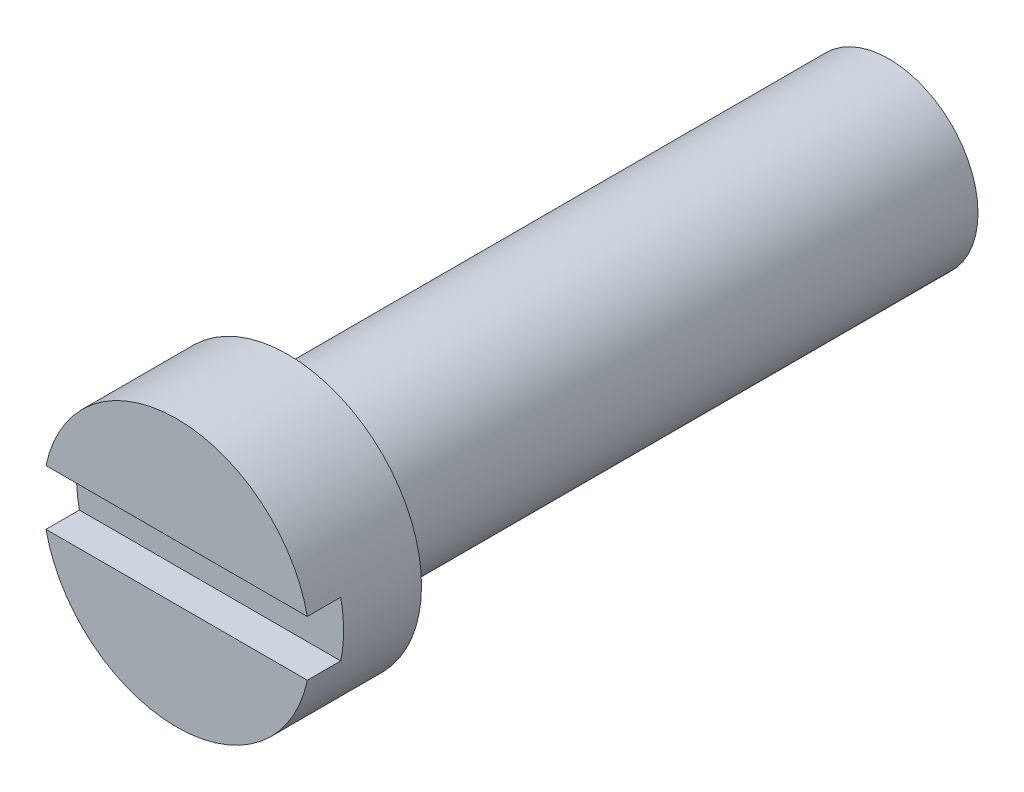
ISO-10303-21;
HEADER;
FILE_DESCRIPTION(('STEP AP214'),'2;1');
FILE_NAME('part.step','',(''),(''),'','','');
FILE_SCHEMA(('AUTOMOTIVE_DESIGN { 1 0 10303 214 1 1 1 1 }'));
ENDSEC;
DATA;
#1=APPLICATION_CONTEXT('core data for automotive mechanical design processes');
#2=APPLICATION_PROTOCOL_DEFINITION('international standard','automotive_design',2000,#1);
#3=PRODUCT_CONTEXT('',#1,'mechanical');
#4=PRODUCT('Part','Part','',(#3));
#5=PRODUCT_RELATED_PRODUCT_CATEGORY('part','',(#4));
#6=PRODUCT_DEFINITION_FORMATION('','',#4);
#7=PRODUCT_DEFINITION_CONTEXT('part definition',#1,'design');
#8=PRODUCT_DEFINITION('design','',#6,#7);
#9=PRODUCT_DEFINITION_SHAPE('','',#8);
#10=(LENGTH_UNIT() NAMED_UNIT(*) SI_UNIT(.MILLI.,.METRE.));
#11=(NAMED_UNIT(*) PLANE_ANGLE_UNIT() SI_UNIT($,.RADIAN.));
#12=(NAMED_UNIT(*) SI_UNIT($,.STERADIAN.) SOLID_ANGLE_UNIT());
#13=UNCERTAINTY_MEASURE_WITH_UNIT(LENGTH_MEASURE(1.E-05),#10,'distance_accuracy_value','');
#14=(GEOMETRIC_REPRESENTATION_CONTEXT(3) GLOBAL_UNCERTAINTY_ASSIGNED_CONTEXT((#13)) GLOBAL_UNIT_ASSIGNED_CONTEXT((#10,
#11,#12)) REPRESENTATION_CONTEXT('',''));
#15=CARTESIAN_POINT('',(0.,0.,0.));
#16=DIRECTION('',(0.,0.,1.));
#17=DIRECTION('',(1.,0.,0.));
#18=AXIS2_PLACEMENT_3D('',#15,#16,#17);
#19=CARTESIAN_POINT('',(35.,4.92661467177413E-13,5.));
#20=DIRECTION('',(0.,0.,1.));
#21=DIRECTION('',(1.,0.,0.));
#22=AXIS2_PLACEMENT_3D('',#19,#20,#21);
#23=PLANE('',#22);
#24=DIRECTION('',(-1.,0.,0.));
#25=VECTOR('',#24,1.);
#26=CARTESIAN_POINT('',(29.129487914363,1.23979347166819,5.));
#27=LINE('',#26,#25);
#28=CARTESIAN_POINT('',(40.870512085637,1.23979347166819,5.));
#29=VERTEX_POINT('',#28);
#30=CARTESIAN_POINT('',(29.129487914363,1.23979347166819,5.));
#31=VERTEX_POINT('',#30);
#32=EDGE_CURVE('E70',#29,#31,#27,.T.);
#33=ORIENTED_EDGE('',*,*,#32,.F.);
#34=CARTESIAN_POINT('',(35.,4.92661467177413E-13,5.));
#35=DIRECTION('',(0.,0.,1.));
#36=DIRECTION('',(1.,0.,0.));
#37=AXIS2_PLACEMENT_3D('',#34,#35,#36);
#38=CIRCLE('',#37,6.00000000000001);
#39=EDGE_CURVE('E107',#29,#31,#38,.T.);
#40=ORIENTED_EDGE('',*,*,#39,.T.);
#41=EDGE_LOOP('',(#33,#40));
#42=FACE_BOUND('',#41,.T.);
#43=ADVANCED_FACE('F32',(#42),#23,.T.);
#44=CARTESIAN_POINT('',(35.,4.92661467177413E-13,-27.));
#45=DIRECTION('',(0.,0.,1.));
#46=DIRECTION('',(1.,0.,0.));
#47=AXIS2_PLACEMENT_3D('',#44,#45,#46);
#48=CYLINDRICAL_SURFACE('',#47,4.);
#49=CARTESIAN_POINT('',(35.,4.92661467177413E-13,-27.));
#50=DIRECTION('',(0.,0.,1.));
#51=DIRECTION('',(1.,0.,0.));
#52=AXIS2_PLACEMENT_3D('',#49,#50,#51);
#53=CIRCLE('',#52,4.);
#54=CARTESIAN_POINT('',(39.,4.92661467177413E-13,-27.));
#55=VERTEX_POINT('',#54);
#56=EDGE_CURVE('E11',#55,#55,#53,.T.);
#57=ORIENTED_EDGE('',*,*,#56,.T.);
#58=EDGE_LOOP('',(#57));
#59=FACE_BOUND('',#58,.T.);
#60=CARTESIAN_POINT('',(35.,4.92661467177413E-13,0.));
#61=DIRECTION('',(0.,0.,1.));
#62=DIRECTION('',(1.,0.,0.));
#63=AXIS2_PLACEMENT_3D('',#60,#61,#62);
#64=CIRCLE('',#63,4.);
#65=CARTESIAN_POINT('',(39.,4.92661467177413E-13,0.));
#66=VERTEX_POINT('',#65);
#67=EDGE_CURVE('E36',#66,#66,#64,.T.);
#68=ORIENTED_EDGE('',*,*,#67,.F.);
#69=EDGE_LOOP('',(#68));
#70=FACE_BOUND('',#69,.T.);
#71=ADVANCED_FACE('F34',(#59,#70),#48,.T.);
#72=CARTESIAN_POINT('',(35.,4.92661467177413E-13,-27.));
#73=DIRECTION('',(0.,0.,1.));
#74=DIRECTION('',(1.,0.,0.));
#75=AXIS2_PLACEMENT_3D('',#72,#73,#74);
#76=PLANE('',#75);
#77=ORIENTED_EDGE('',*,*,#56,.F.);
#78=EDGE_LOOP('',(#77));
#79=FACE_BOUND('',#78,.T.);
#80=ADVANCED_FACE('F121',(#79),#76,.F.);
#81=CARTESIAN_POINT('',(35.,4.92661467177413E-13,5.));
#82=DIRECTION('',(0.,0.,-1.));
#83=DIRECTION('',(-1.,0.,0.));
#84=AXIS2_PLACEMENT_3D('',#81,#82,#83);
#85=CYLINDRICAL_SURFACE('',#84,6.00000000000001);
#86=CARTESIAN_POINT('',(35.0000000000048,0.,3.5));
#87=DIRECTION('',(0.,0.,1.));
#88=DIRECTION('',(1.,0.,0.));
#89=AXIS2_PLACEMENT_3D('',#86,#87,#88);
#90=CIRCLE('',#89,6.00000000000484);
#91=CARTESIAN_POINT('',(29.129487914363,1.23979347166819,3.5));
#92=VERTEX_POINT('',#91);
#93=CARTESIAN_POINT('',(29.129487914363,-1.23979347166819,3.5));
#94=VERTEX_POINT('',#93);
#95=EDGE_CURVE('E90',#92,#94,#90,.T.);
#96=ORIENTED_EDGE('',*,*,#95,.F.);
#97=DIRECTION('',(0.,0.,1.));
#98=VECTOR('',#97,1.);
#99=CARTESIAN_POINT('',(29.129487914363,1.23979347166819,3.5));
#100=LINE('',#99,#98);
#101=EDGE_CURVE('E56',#92,#31,#100,.T.);
#102=ORIENTED_EDGE('',*,*,#101,.T.);
#103=ORIENTED_EDGE('',*,*,#39,.F.);
#104=DIRECTION('',(0.,0.,1.));
#105=VECTOR('',#104,1.);
#106=CARTESIAN_POINT('',(40.870512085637,1.23979347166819,3.5));
#107=LINE('',#106,#105);
#108=CARTESIAN_POINT('',(40.870512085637,1.23979347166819,3.5));
#109=VERTEX_POINT('',#108);
#110=EDGE_CURVE('E84',#109,#29,#107,.T.);
#111=ORIENTED_EDGE('',*,*,#110,.F.);
#112=CARTESIAN_POINT('',(34.9999999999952,0.,3.5));
#113=DIRECTION('',(0.,0.,1.));
#114=DIRECTION('',(-1.,0.,0.));
#115=AXIS2_PLACEMENT_3D('',#112,#113,#114);
#116=CIRCLE('',#115,6.00000000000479);
#117=CARTESIAN_POINT('',(40.870512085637,-1.23979347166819,3.5));
#118=VERTEX_POINT('',#117);
#119=EDGE_CURVE('E88',#118,#109,#116,.T.);
#120=ORIENTED_EDGE('',*,*,#119,.F.);
#121=DIRECTION('',(0.,0.,1.));
#122=VECTOR('',#121,1.);
#123=CARTESIAN_POINT('',(40.870512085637,-1.23979347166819,3.5));
#124=LINE('',#123,#122);
#125=CARTESIAN_POINT('',(40.870512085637,-1.23979347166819,5.));
#126=VERTEX_POINT('',#125);
#127=EDGE_CURVE('E77',#118,#126,#124,.T.);
#128=ORIENTED_EDGE('',*,*,#127,.T.);
#129=CARTESIAN_POINT('',(29.1294879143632,-1.23979347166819,5.));
#130=VERTEX_POINT('',#129);
#131=EDGE_CURVE('E110',#130,#126,#38,.T.);
#132=ORIENTED_EDGE('',*,*,#131,.F.);
#133=DIRECTION('',(0.,0.,1.));
#134=VECTOR('',#133,1.);
#135=CARTESIAN_POINT('',(29.129487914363,-1.23979347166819,3.5));
#136=LINE('',#135,#134);
#137=EDGE_CURVE('E47',#94,#130,#136,.T.);
#138=ORIENTED_EDGE('',*,*,#137,.F.);
#139=EDGE_LOOP('',(#96,#102,#103,#111,#120,#128,#132,#138));
#140=FACE_BOUND('',#139,.T.);
#141=CARTESIAN_POINT('',(35.,4.92661467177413E-13,0.));
#142=DIRECTION('',(0.,0.,1.));
#143=DIRECTION('',(1.,0.,0.));
#144=AXIS2_PLACEMENT_3D('',#141,#142,#143);
#145=CIRCLE('',#144,6.00000000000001);
#146=CARTESIAN_POINT('',(41.,4.92661467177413E-13,0.));
#147=VERTEX_POINT('',#146);
#148=EDGE_CURVE('E104',#147,#147,#145,.T.);
#149=ORIENTED_EDGE('',*,*,#148,.T.);
#150=EDGE_LOOP('',(#149));
#151=FACE_BOUND('',#150,.T.);
#152=ADVANCED_FACE('F93',(#140,#151),#85,.T.);
#153=DIRECTION('',(1.,0.,0.));
#154=VECTOR('',#153,1.);
#155=CARTESIAN_POINT('',(29.129487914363,-1.23979347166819,5.));
#156=LINE('',#155,#154);
#157=EDGE_CURVE('E79',#130,#126,#156,.T.);
#158=ORIENTED_EDGE('',*,*,#157,.F.);
#159=ORIENTED_EDGE('',*,*,#131,.T.);
#160=EDGE_LOOP('',(#158,#159));
#161=FACE_BOUND('',#160,.T.);
#162=ADVANCED_FACE('F114',(#161),#23,.T.);
#163=CARTESIAN_POINT('',(35.,4.92661467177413E-13,0.));
#164=DIRECTION('',(0.,0.,1.));
#165=DIRECTION('',(1.,0.,0.));
#166=AXIS2_PLACEMENT_3D('',#163,#164,#165);
#167=PLANE('',#166);
#168=ORIENTED_EDGE('',*,*,#67,.T.);
#169=EDGE_LOOP('',(#168));
#170=FACE_BOUND('',#169,.T.);
#171=ORIENTED_EDGE('',*,*,#148,.F.);
#172=EDGE_LOOP('',(#171));
#173=FACE_BOUND('',#172,.T.);
#174=ADVANCED_FACE('F126',(#170,#173),#167,.F.);
#175=CARTESIAN_POINT('',(29.129487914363,1.23979347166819,3.5));
#176=DIRECTION('',(0.,1.,0.));
#177=DIRECTION('',(0.,0.,1.));
#178=AXIS2_PLACEMENT_3D('',#175,#176,#177);
#179=PLANE('',#178);
#180=ORIENTED_EDGE('',*,*,#32,.T.);
#181=ORIENTED_EDGE('',*,*,#101,.F.);
#182=DIRECTION('',(-1.,0.,0.));
#183=VECTOR('',#182,1.);
#184=CARTESIAN_POINT('',(29.129487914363,1.23979347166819,3.5));
#185=LINE('',#184,#183);
#186=EDGE_CURVE('E96',#109,#92,#185,.T.);
#187=ORIENTED_EDGE('',*,*,#186,.F.);
#188=ORIENTED_EDGE('',*,*,#110,.T.);
#189=EDGE_LOOP('',(#180,#181,#187,#188));
#190=FACE_BOUND('',#189,.T.);
#191=ADVANCED_FACE('F131',(#190),#179,.F.);
#192=CARTESIAN_POINT('',(29.129487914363,-1.23979347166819,3.5));
#193=DIRECTION('',(0.,-1.,0.));
#194=DIRECTION('',(0.,0.,-1.));
#195=AXIS2_PLACEMENT_3D('',#192,#193,#194);
#196=PLANE('',#195);
#197=ORIENTED_EDGE('',*,*,#157,.T.);
#198=ORIENTED_EDGE('',*,*,#127,.F.);
#199=DIRECTION('',(1.,0.,0.));
#200=VECTOR('',#199,1.);
#201=CARTESIAN_POINT('',(29.129487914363,-1.23979347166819,3.5));
#202=LINE('',#201,#200);
#203=EDGE_CURVE('E74',#94,#118,#202,.T.);
#204=ORIENTED_EDGE('',*,*,#203,.F.);
#205=ORIENTED_EDGE('',*,*,#137,.T.);
#206=EDGE_LOOP('',(#197,#198,#204,#205));
#207=FACE_BOUND('',#206,.T.);
#208=ADVANCED_FACE('F78',(#207),#196,.F.);
#209=CARTESIAN_POINT('',(35.0000000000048,0.,3.5));
#210=DIRECTION('',(0.,0.,1.));
#211=DIRECTION('',(1.,0.,0.));
#212=AXIS2_PLACEMENT_3D('',#209,#210,#211);
#213=PLANE('',#212);
#214=ORIENTED_EDGE('',*,*,#95,.T.);
#215=ORIENTED_EDGE('',*,*,#203,.T.);
#216=ORIENTED_EDGE('',*,*,#119,.T.);
#217=ORIENTED_EDGE('',*,*,#186,.T.);
#218=EDGE_LOOP('',(#214,#215,#216,#217));
#219=FACE_BOUND('',#218,.T.);
#220=ADVANCED_FACE('F87',(#219),#213,.T.);
#221=CLOSED_SHELL('',(#43,#71,#80,#152,#162,#174,#191,#208,#220));
#222=MANIFOLD_SOLID_BREP('B2',#221);
#223=ADVANCED_BREP_SHAPE_REPRESENTATION('',(#18,#222),#14);
#224=SHAPE_DEFINITION_REPRESENTATION(#9,#223);
ENDSEC;
END-ISO-10303-21;
